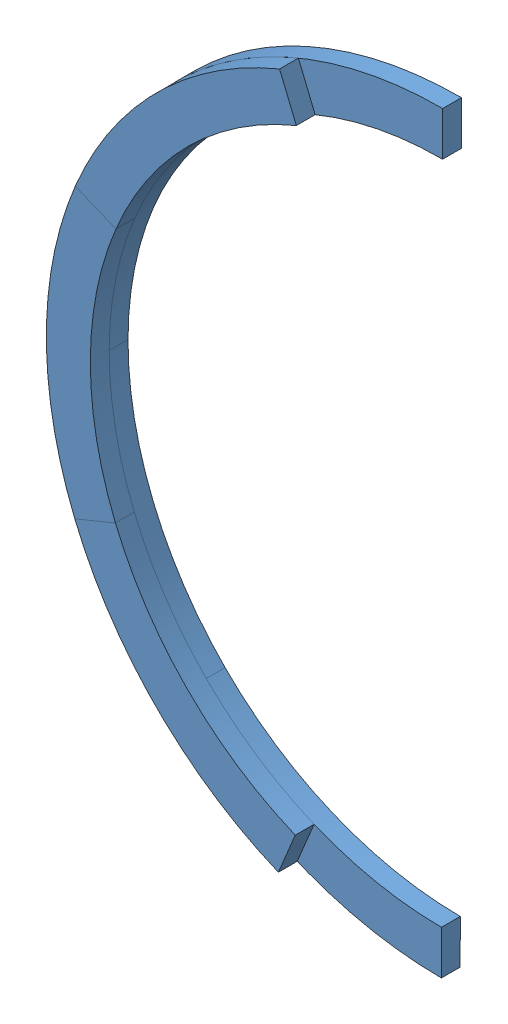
SolidWorks assembly arch-assembly.SLDASM, configuration Default (file format 13000). Lengths in mm.
Overall size (848.75 1631.18 76.2).
9 component instances, 2 part files, 9 mates.
Components (placement in the parent):
- arch-22-5-degrees-1: arch-22-5-degrees.SLDPRT [Default] at (-162.1782 146.1434 328.828) size (291.7 139.7 38.1)
- arch-45-degrees-1: arch-45-degrees.SLDPRT [Default] at (-380.7951 0.6049 290.728) x (0.92388 0.382683 0) z (0 0 1) size (583.21 140.58 38.1)
- arch-45-degrees-2: arch-45-degrees.SLDPRT [Default] at (-578.7498 -475.0131 290.728) x (0.382683 0.92388 0) z (0 0 1) size (583.21 140.58 38.1)
- arch-45-degrees-3: arch-45-degrees.SLDPRT [Default] at (-382.4122 -951.3009 290.728) x (-0.382683 0.92388 0) z (0 0 1) size (583.21 140.58 38.1)
- arch-22-5-degrees-2: arch-22-5-degrees.SLDPRT [Default] at (-164.291 -1097.5814 366.928) x (0.999994 -0.003398 0) z (0 0 -1) size (291.7 139.7 38.1)
- arch-45-degrees-4: arch-45-degrees.SLDPRT [Default] at (-527.0756 -217.5163 328.828) x (0.707107 0.707107 0) z (0 0 1) size (583.21 140.58 38.1)
- arch-45-degrees-5: arch-45-degrees.SLDPRT [Default] at (-527.9507 -732.684 328.828) x (0 1 0) z (0 0 1) size (583.21 140.58 38.1)
- arch-45-degrees-6: arch-45-degrees.SLDPRT [Default] at (93.2058 -1149.2556 290.728) x (-0.92388 0.382683 0) z (0 0 1) size (583.21 140.58 38.1)
- arch-45-degrees-7: arch-45-degrees.SLDPRT [Default] at (-164.291 -1097.5814 328.828) x (-0.707107 0.707107 0) z (0 0 1) size (583.21 140.58 38.1)
Mates (geometry in assembly coordinates):
- Coincident1: coincident aligned: plane of arch-30-degrees-1 through (95.4057 145.7058 366.928) normal (0.999999 -0.001699 0); plane of arch-45-degrees-1 through (95.1578 -0.2037 328.828) normal (0.999999 -0.001699 0)
- Coincident2: coincident anti-aligned: plane of arch-30-degrees-1 through (-162.1782 146.1434 328.828) normal (0 0 -1); plane of arch-45-degrees-1 through (-380.7951 0.6049 328.828) normal (0 0 1)
- Coincident3: coincident: point of arch-30-degrees-1; point of arch-45-degrees-1
- Coincident5: coincident anti-aligned: plane of arch-45-degrees-3 through (-382.4122 -951.3009 328.828) normal (0 0 1); plane of arch-22-5-degrees-2 through (-164.291 -1097.5814 328.828) normal (0 0 -1)
- Coincident7: coincident anti-aligned: plane of arch-30-degrees-1 through (-162.1782 146.1434 366.928) normal (-0.924528 -0.381113 0); plane of arch-45-degrees-4 through (-87.043 -36.124 366.928) normal (0.924528 0.381113 0)
- Coincident8: coincident: point of arch-30-degrees-1; point of arch-45-degrees-4
- Coincident9: coincident anti-aligned: plane of arch-45-degrees-1 through (-380.7951 0.6049 328.828) normal (0 0 1); plane of arch-45-degrees-4 through (-527.0756 -217.5163 328.828) normal (0 0 -1)
- Coincident10: coincident anti-aligned: plane of arch-30-degrees-2 through (-164.291 -1097.5814 328.828) normal (-0.923228 0.384252 0); plane of arch-45-degrees-7 through (-164.291 -1097.5814 366.928) normal (0.923228 -0.384252 0)
- Coincident11: coincident: point of arch-30-degrees-2; point of arch-45-degrees-6
